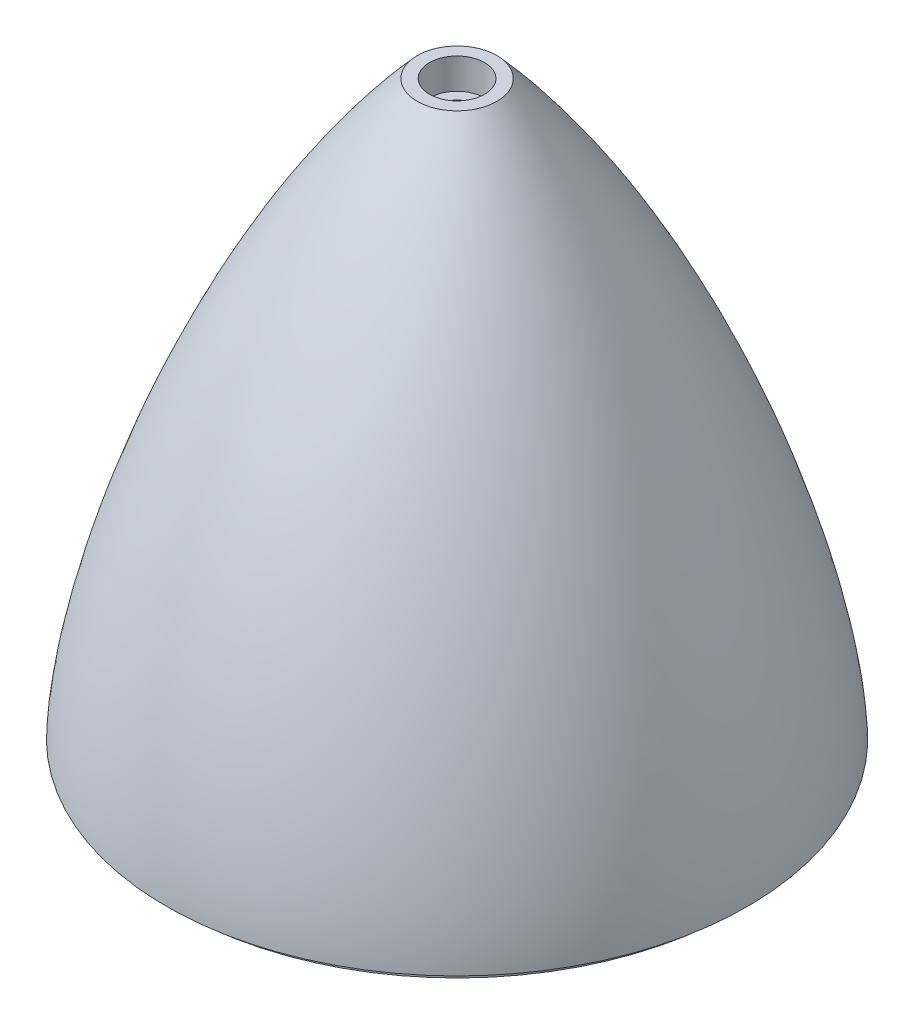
from build123d import *

# Parameters (mm, degrees)
ESQUISSE2_W = 4.25
ESQUISSE2_H = 1.5


with BuildPart() as part:
    # Esquisse1 → R_volution1 (revolve)
    with BuildSketch(Plane.XY, mode=Mode.PRIVATE) as r_volution1_sk:
        with BuildLine():
            Line((-44.25, 0), (-47.5, 0))
            add(Edge.make_bspline(
                [(-6.5, 95), (-33.036242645, 65.421619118), (-47.5, 18.346104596), (-47.5, 0)],
                knots=[0, 0, 0, 0, 1, 1, 1, 1], degree=3))
            Line((-6.5, 95), (-4.5, 95))
            Line((-4.5, 95), (-4.5, 90))
            Line((-4.5, 90), (-2.75, 90))
            Line((-2.75, 90), (-2.75, 84))
            Line((-2.75, 84), (-11.272357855, 84))
            add(Edge.make_bspline(
                [(-11.272357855, 84), (-11.932736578, 83.111061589), (-14.039167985, 80.202210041), (-17.440982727, 75.114676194), (-22.627042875, 66.513512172), (-28.394937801, 55.394892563), (-34.128055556, 42.019004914), (-37.883403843, 31.307506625), (-40.256771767, 23.280713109), (-41.717258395, 17.603650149), (-42.854355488, 12.343223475), (-43.529665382, 8.370425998), (-43.905675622, 5.481032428), (-44.105709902, 3.468703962), (-44.204534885, 1.935830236), (-44.243589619, 0.792876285), (-44.25, 0.268212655), (-44.25, 0)],
                knots=[0.097026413, 0.097026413, 0.097026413, 0.097026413, 0.125, 0.1875, 0.25, 0.375, 0.5, 0.625, 0.6875, 0.75, 0.8125, 0.875, 0.90625, 0.9375, 0.96875, 0.984375, 1, 1, 1, 1], degree=3))
        make_face()
    revolve(r_volution1_sk.sketch.rotate(Axis((0, 0, 0), (0, 1, 0)), 270), axis=Axis((0, 0, 0), (0, 1, 0)))

    # Esquisse2 → Enl_vement de mati_re-R_volution1 (revolve, cut)
    with BuildSketch(Plane.XY, mode=Mode.PRIVATE) as enl_vement_de_mati_re_r_volution1_sk:
        with Locations((-47.875, 0.75)):
            Rectangle(ESQUISSE2_W, ESQUISSE2_H)
    revolve(enl_vement_de_mati_re_r_volution1_sk.sketch.rotate(Axis((0, 0, 0), (0, 1, 0)), 270), axis=Axis((0, 0, 0), (0, 1, 0)), mode=Mode.SUBTRACT)


solid = part.part
